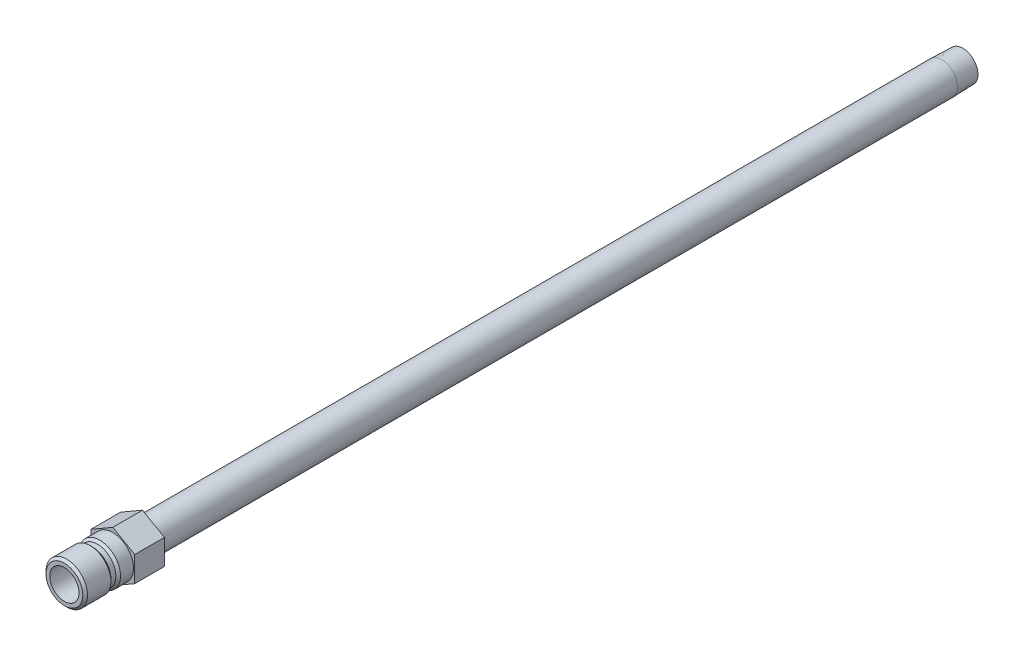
from build123d import *

# Parameters (mm, degrees)
SKETCH2_R           = 4.7625
BOSS_EXTRUDE1_DEPTH = 9.652


with BuildPart() as part:
    # Sketch1 → Revolve1 (revolve)
    with BuildSketch(Plane(origin=(0, 0, 0), x_dir=(0, 0, -1), z_dir=(1, 0, 0))):
        Polygon((-15.748, 4.7625), (-15.748, 5.9817), (-14.986, 6.7437), (-7.366, 6.7437), (-6.604, 5.9817), (-5.0165, 5.9817), (-4.2545, 6.7437), (9.652, 6.7437), (9.652, 5.1435), (269.494, 5.1435), (276.352, 4.929188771), (276.352, 3.4163), (-2.840212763, 3.4163), (-3.556, 4.7625), align=None)
    revolve(axis=Axis((0, 0, -9.652), (0, 0, 1)))

    # Sketch2 → Boss-Extrude1 (add)
    with BuildSketch(Plane.XY):
        Polygon((-7.112, 4.106115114), (-7.112, -4.106115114), (0, -8.212230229), (7.112, -4.106115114), (7.112, 4.106115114), (0, 8.212230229), align=None)
        with Locations(Location((0, 0, 0), (0, 0, 90))):
            Circle(SKETCH2_R, mode=Mode.SUBTRACT)
    extrude(amount=-BOSS_EXTRUDE1_DEPTH)


solid = part.part
